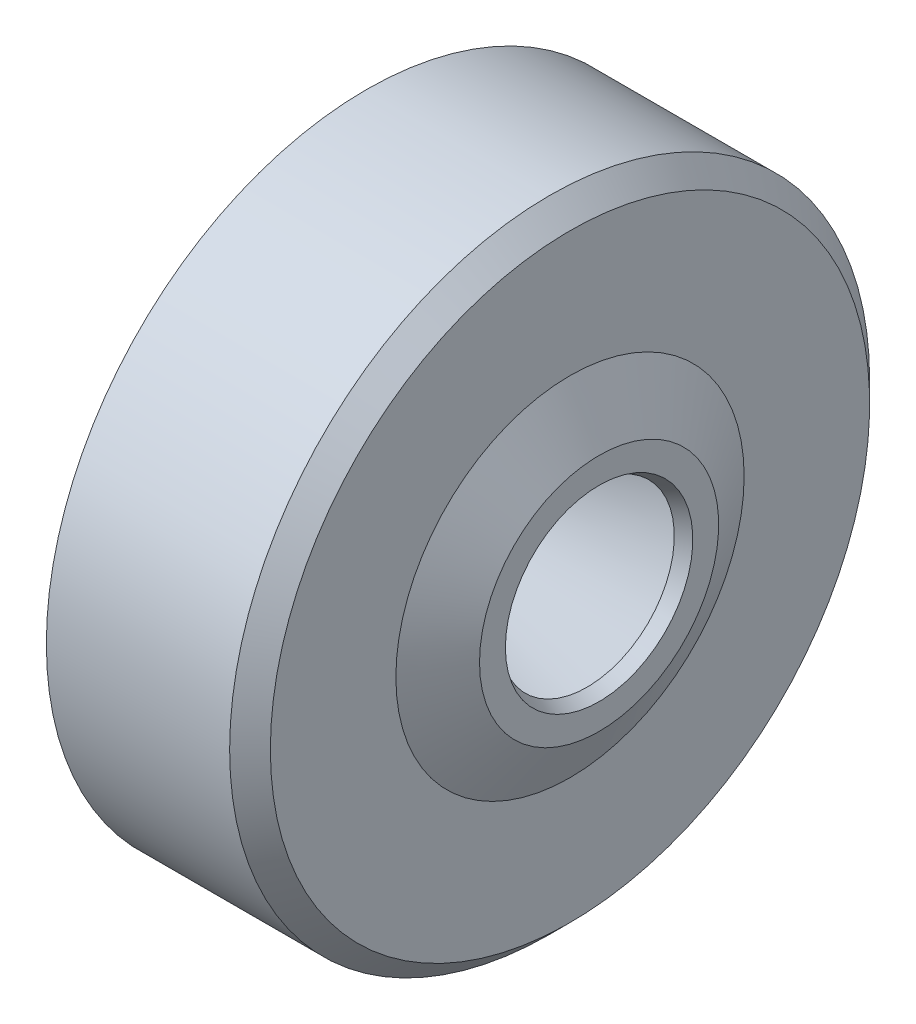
ISO-10303-21;
HEADER;
FILE_DESCRIPTION(('STEP AP214'),'2;1');
FILE_NAME('part.step','',(''),(''),'','','');
FILE_SCHEMA(('AUTOMOTIVE_DESIGN { 1 0 10303 214 1 1 1 1 }'));
ENDSEC;
DATA;
#1=APPLICATION_CONTEXT('core data for automotive mechanical design processes');
#2=APPLICATION_PROTOCOL_DEFINITION('international standard','automotive_design',2000,#1);
#3=PRODUCT_CONTEXT('',#1,'mechanical');
#4=PRODUCT('Part','Part','',(#3));
#5=PRODUCT_RELATED_PRODUCT_CATEGORY('part','',(#4));
#6=PRODUCT_DEFINITION_FORMATION('','',#4);
#7=PRODUCT_DEFINITION_CONTEXT('part definition',#1,'design');
#8=PRODUCT_DEFINITION('design','',#6,#7);
#9=PRODUCT_DEFINITION_SHAPE('','',#8);
#10=(LENGTH_UNIT() NAMED_UNIT(*) SI_UNIT(.MILLI.,.METRE.));
#11=(NAMED_UNIT(*) PLANE_ANGLE_UNIT() SI_UNIT($,.RADIAN.));
#12=(NAMED_UNIT(*) SI_UNIT($,.STERADIAN.) SOLID_ANGLE_UNIT());
#13=UNCERTAINTY_MEASURE_WITH_UNIT(LENGTH_MEASURE(1.E-05),#10,'distance_accuracy_value','');
#14=(GEOMETRIC_REPRESENTATION_CONTEXT(3) GLOBAL_UNCERTAINTY_ASSIGNED_CONTEXT((#13)) GLOBAL_UNIT_ASSIGNED_CONTEXT((#10,
#11,#12)) REPRESENTATION_CONTEXT('',''));
#15=CARTESIAN_POINT('',(0.,0.,0.));
#16=DIRECTION('',(0.,0.,1.));
#17=DIRECTION('',(1.,0.,0.));
#18=AXIS2_PLACEMENT_3D('',#15,#16,#17);
#19=CARTESIAN_POINT('',(2.10000000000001,0.,0.));
#20=DIRECTION('',(1.,0.,0.));
#21=DIRECTION('',(0.,0.,-1.));
#22=AXIS2_PLACEMENT_3D('',#19,#20,#21);
#23=CONICAL_SURFACE('',#22,3.,0.547251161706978);
#24=CARTESIAN_POINT('',(2.10000000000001,0.,0.));
#25=DIRECTION('',(-1.,0.,0.));
#26=DIRECTION('',(0.,0.,1.));
#27=AXIS2_PLACEMENT_3D('',#24,#25,#26);
#28=CIRCLE('',#27,3.);
#29=CARTESIAN_POINT('',(2.10000000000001,0.,3.));
#30=VERTEX_POINT('',#29);
#31=EDGE_CURVE('E65',#30,#30,#28,.T.);
#32=ORIENTED_EDGE('',*,*,#31,.T.);
#33=EDGE_LOOP('',(#32));
#34=FACE_BOUND('',#33,.T.);
#35=CARTESIAN_POINT('',(6.23967494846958,0.,0.));
#36=DIRECTION('',(-1.,0.,0.));
#37=DIRECTION('',(0.,0.,1.));
#38=AXIS2_PLACEMENT_3D('',#35,#36,#37);
#39=CIRCLE('',#38,5.52242584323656);
#40=CARTESIAN_POINT('',(6.23967494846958,0.,5.52242584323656));
#41=VERTEX_POINT('',#40);
#42=EDGE_CURVE('E10',#41,#41,#39,.T.);
#43=ORIENTED_EDGE('',*,*,#42,.F.);
#44=EDGE_LOOP('',(#43));
#45=FACE_BOUND('',#44,.T.);
#46=ADVANCED_FACE('F33',(#34,#45),#23,.F.);
#47=CARTESIAN_POINT('',(3.96666666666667,0.,0.));
#48=DIRECTION('',(-1.,0.,0.));
#49=DIRECTION('',(0.,0.,1.));
#50=AXIS2_PLACEMENT_3D('',#47,#48,#49);
#51=TOROIDAL_SURFACE('',#50,8.52222222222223,0.699999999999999);
#52=CARTESIAN_POINT('',(4.66666666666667,0.,0.));
#53=DIRECTION('',(-1.,0.,0.));
#54=DIRECTION('',(0.,0.,1.));
#55=AXIS2_PLACEMENT_3D('',#52,#53,#54);
#56=CIRCLE('',#55,8.52222222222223);
#57=CARTESIAN_POINT('',(4.66666666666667,0.,8.52222222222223));
#58=VERTEX_POINT('',#57);
#59=EDGE_CURVE('E40',#58,#58,#56,.T.);
#60=ORIENTED_EDGE('',*,*,#59,.F.);
#61=EDGE_LOOP('',(#60));
#62=FACE_BOUND('',#61,.T.);
#63=CARTESIAN_POINT('',(3.96666666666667,0.,0.));
#64=DIRECTION('',(-1.,0.,0.));
#65=DIRECTION('',(0.,0.,1.));
#66=AXIS2_PLACEMENT_3D('',#63,#64,#65);
#67=CIRCLE('',#66,9.22222222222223);
#68=CARTESIAN_POINT('',(3.96666666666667,0.,9.22222222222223));
#69=VERTEX_POINT('',#68);
#70=EDGE_CURVE('E80',#69,#69,#67,.T.);
#71=ORIENTED_EDGE('',*,*,#70,.T.);
#72=EDGE_LOOP('',(#71));
#73=FACE_BOUND('',#72,.T.);
#74=ADVANCED_FACE('F35',(#62,#73),#51,.F.);
#75=CARTESIAN_POINT('',(4.66666666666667,8.52222222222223,0.));
#76=DIRECTION('',(1.,0.,0.));
#77=DIRECTION('',(0.,0.,-1.));
#78=AXIS2_PLACEMENT_3D('',#75,#76,#77);
#79=PLANE('',#78);
#80=CARTESIAN_POINT('',(4.66666666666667,0.,0.));
#81=DIRECTION('',(-1.,0.,0.));
#82=DIRECTION('',(0.,0.,1.));
#83=AXIS2_PLACEMENT_3D('',#80,#81,#82);
#84=CIRCLE('',#83,5.98571428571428);
#85=CARTESIAN_POINT('',(4.66666666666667,0.,5.98571428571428));
#86=VERTEX_POINT('',#85);
#87=EDGE_CURVE('E44',#86,#86,#84,.T.);
#88=ORIENTED_EDGE('',*,*,#87,.F.);
#89=EDGE_LOOP('',(#88));
#90=FACE_BOUND('',#89,.T.);
#91=ORIENTED_EDGE('',*,*,#59,.T.);
#92=EDGE_LOOP('',(#91));
#93=FACE_BOUND('',#92,.T.);
#94=ADVANCED_FACE('F132',(#90,#93),#79,.F.);
#95=CARTESIAN_POINT('',(3.96666666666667,0.,0.));
#96=DIRECTION('',(-1.,0.,0.));
#97=DIRECTION('',(0.,0.,1.));
#98=AXIS2_PLACEMENT_3D('',#95,#96,#97);
#99=TOROIDAL_SURFACE('',#98,5.98571428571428,0.699999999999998);
#100=CARTESIAN_POINT('',(3.96666666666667,0.,0.));
#101=DIRECTION('',(-1.,0.,0.));
#102=DIRECTION('',(0.,0.,1.));
#103=AXIS2_PLACEMENT_3D('',#100,#101,#102);
#104=CIRCLE('',#103,5.28571428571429);
#105=CARTESIAN_POINT('',(3.96666666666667,0.,5.28571428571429));
#106=VERTEX_POINT('',#105);
#107=EDGE_CURVE('E48',#106,#106,#104,.T.);
#108=ORIENTED_EDGE('',*,*,#107,.F.);
#109=EDGE_LOOP('',(#108));
#110=FACE_BOUND('',#109,.T.);
#111=ORIENTED_EDGE('',*,*,#87,.T.);
#112=EDGE_LOOP('',(#111));
#113=FACE_BOUND('',#112,.T.);
#114=ADVANCED_FACE('F157',(#110,#113),#99,.F.);
#115=CARTESIAN_POINT('',(-7.00000000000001,0.,0.));
#116=DIRECTION('',(-1.,0.,0.));
#117=DIRECTION('',(0.,0.,1.));
#118=AXIS2_PLACEMENT_3D('',#115,#116,#117);
#119=CYLINDRICAL_SURFACE('',#118,5.28571428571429);
#120=CARTESIAN_POINT('',(2.10000000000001,0.,0.));
#121=DIRECTION('',(-1.,0.,0.));
#122=DIRECTION('',(0.,0.,1.));
#123=AXIS2_PLACEMENT_3D('',#120,#121,#122);
#124=CIRCLE('',#123,5.28571428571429);
#125=CARTESIAN_POINT('',(2.10000000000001,0.,5.28571428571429));
#126=VERTEX_POINT('',#125);
#127=EDGE_CURVE('E53',#126,#126,#124,.T.);
#128=ORIENTED_EDGE('',*,*,#127,.F.);
#129=EDGE_LOOP('',(#128));
#130=FACE_BOUND('',#129,.T.);
#131=ORIENTED_EDGE('',*,*,#107,.T.);
#132=EDGE_LOOP('',(#131));
#133=FACE_BOUND('',#132,.T.);
#134=ADVANCED_FACE('F153',(#130,#133),#119,.T.);
#135=CARTESIAN_POINT('',(2.10000000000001,0.,0.));
#136=DIRECTION('',(-1.,0.,0.));
#137=DIRECTION('',(0.,0.,1.));
#138=AXIS2_PLACEMENT_3D('',#135,#136,#137);
#139=TOROIDAL_SURFACE('',#138,5.98571428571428,0.699999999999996);
#140=CARTESIAN_POINT('',(1.40000000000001,0.,0.));
#141=DIRECTION('',(-1.,0.,0.));
#142=DIRECTION('',(0.,0.,1.));
#143=AXIS2_PLACEMENT_3D('',#140,#141,#142);
#144=CIRCLE('',#143,5.98571428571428);
#145=CARTESIAN_POINT('',(1.40000000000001,0.,5.98571428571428));
#146=VERTEX_POINT('',#145);
#147=EDGE_CURVE('E56',#146,#146,#144,.T.);
#148=ORIENTED_EDGE('',*,*,#147,.F.);
#149=EDGE_LOOP('',(#148));
#150=FACE_BOUND('',#149,.T.);
#151=ORIENTED_EDGE('',*,*,#127,.T.);
#152=EDGE_LOOP('',(#151));
#153=FACE_BOUND('',#152,.T.);
#154=ADVANCED_FACE('F149',(#150,#153),#139,.T.);
#155=CARTESIAN_POINT('',(-7.00000000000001,0.,0.));
#156=DIRECTION('',(-1.,0.,0.));
#157=DIRECTION('',(0.,0.,1.));
#158=AXIS2_PLACEMENT_3D('',#155,#156,#157);
#159=CYLINDRICAL_SURFACE('',#158,5.98571428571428);
#160=CARTESIAN_POINT('',(0.700000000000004,0.,0.));
#161=DIRECTION('',(-1.,0.,0.));
#162=DIRECTION('',(0.,0.,1.));
#163=AXIS2_PLACEMENT_3D('',#160,#161,#162);
#164=CIRCLE('',#163,5.98571428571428);
#165=CARTESIAN_POINT('',(0.700000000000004,0.,5.98571428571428));
#166=VERTEX_POINT('',#165);
#167=EDGE_CURVE('E59',#166,#166,#164,.T.);
#168=ORIENTED_EDGE('',*,*,#167,.F.);
#169=EDGE_LOOP('',(#168));
#170=FACE_BOUND('',#169,.T.);
#171=ORIENTED_EDGE('',*,*,#147,.T.);
#172=EDGE_LOOP('',(#171));
#173=FACE_BOUND('',#172,.T.);
#174=ADVANCED_FACE('F145',(#170,#173),#159,.T.);
#175=CARTESIAN_POINT('',(0.700000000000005,5.98571428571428,0.));
#176=DIRECTION('',(1.,0.,0.));
#177=DIRECTION('',(0.,0.,-1.));
#178=AXIS2_PLACEMENT_3D('',#175,#176,#177);
#179=PLANE('',#178);
#180=CARTESIAN_POINT('',(0.700000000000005,0.,0.));
#181=DIRECTION('',(-1.,0.,0.));
#182=DIRECTION('',(0.,0.,1.));
#183=AXIS2_PLACEMENT_3D('',#180,#181,#182);
#184=CIRCLE('',#183,4.11939942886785);
#185=CARTESIAN_POINT('',(0.700000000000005,0.,4.11939942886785));
#186=VERTEX_POINT('',#185);
#187=EDGE_CURVE('E62',#186,#186,#184,.T.);
#188=ORIENTED_EDGE('',*,*,#187,.F.);
#189=EDGE_LOOP('',(#188));
#190=FACE_BOUND('',#189,.T.);
#191=ORIENTED_EDGE('',*,*,#167,.T.);
#192=EDGE_LOOP('',(#191));
#193=FACE_BOUND('',#192,.T.);
#194=ADVANCED_FACE('F141',(#190,#193),#179,.F.);
#195=CARTESIAN_POINT('',(0.700000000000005,0.,0.));
#196=DIRECTION('',(-1.,0.,0.));
#197=DIRECTION('',(0.,0.,1.));
#198=AXIS2_PLACEMENT_3D('',#195,#196,#197);
#199=CONICAL_SURFACE('',#198,4.11939942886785,0.674479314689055);
#200=ORIENTED_EDGE('',*,*,#31,.F.);
#201=EDGE_LOOP('',(#200));
#202=FACE_BOUND('',#201,.T.);
#203=ORIENTED_EDGE('',*,*,#187,.T.);
#204=EDGE_LOOP('',(#203));
#205=FACE_BOUND('',#204,.T.);
#206=ADVANCED_FACE('F138',(#202,#205),#199,.F.);
#207=CARTESIAN_POINT('',(7.00000000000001,5.98571428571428,0.));
#208=DIRECTION('',(-1.,0.,0.));
#209=DIRECTION('',(0.,0.,1.));
#210=AXIS2_PLACEMENT_3D('',#207,#208,#209);
#211=PLANE('',#210);
#212=CARTESIAN_POINT('',(7.00000000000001,0.,0.));
#213=DIRECTION('',(-1.,0.,0.));
#214=DIRECTION('',(0.,0.,1.));
#215=AXIS2_PLACEMENT_3D('',#212,#213,#214);
#216=CIRCLE('',#215,10.3);
#217=CARTESIAN_POINT('',(7.00000000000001,0.,10.3));
#218=VERTEX_POINT('',#217);
#219=EDGE_CURVE('E68',#218,#218,#216,.T.);
#220=ORIENTED_EDGE('',*,*,#219,.F.);
#221=EDGE_LOOP('',(#220));
#222=FACE_BOUND('',#221,.T.);
#223=CARTESIAN_POINT('',(7.00000000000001,0.,0.));
#224=DIRECTION('',(-1.,0.,0.));
#225=DIRECTION('',(0.,0.,1.));
#226=AXIS2_PLACEMENT_3D('',#223,#224,#225);
#227=CIRCLE('',#226,5.98571428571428);
#228=CARTESIAN_POINT('',(7.00000000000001,0.,5.98571428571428));
#229=VERTEX_POINT('',#228);
#230=EDGE_CURVE('E92',#229,#229,#227,.T.);
#231=ORIENTED_EDGE('',*,*,#230,.T.);
#232=EDGE_LOOP('',(#231));
#233=FACE_BOUND('',#232,.T.);
#234=ADVANCED_FACE('F96',(#222,#233),#211,.F.);
#235=CARTESIAN_POINT('',(7.00000000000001,0.,0.));
#236=DIRECTION('',(-1.,0.,0.));
#237=DIRECTION('',(0.,0.,1.));
#238=AXIS2_PLACEMENT_3D('',#235,#236,#237);
#239=CONICAL_SURFACE('',#238,10.3,0.785398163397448);
#240=CARTESIAN_POINT('',(6.30000000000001,0.,0.));
#241=DIRECTION('',(-1.,0.,0.));
#242=DIRECTION('',(0.,0.,1.));
#243=AXIS2_PLACEMENT_3D('',#240,#241,#242);
#244=CIRCLE('',#243,11.);
#245=CARTESIAN_POINT('',(6.30000000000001,0.,11.));
#246=VERTEX_POINT('',#245);
#247=EDGE_CURVE('E71',#246,#246,#244,.T.);
#248=ORIENTED_EDGE('',*,*,#247,.F.);
#249=EDGE_LOOP('',(#248));
#250=FACE_BOUND('',#249,.T.);
#251=ORIENTED_EDGE('',*,*,#219,.T.);
#252=EDGE_LOOP('',(#251));
#253=FACE_BOUND('',#252,.T.);
#254=ADVANCED_FACE('F199',(#250,#253),#239,.T.);
#255=CARTESIAN_POINT('',(-7.00000000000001,0.,0.));
#256=DIRECTION('',(-1.,0.,0.));
#257=DIRECTION('',(0.,0.,1.));
#258=AXIS2_PLACEMENT_3D('',#255,#256,#257);
#259=CYLINDRICAL_SURFACE('',#258,11.);
#260=CARTESIAN_POINT('',(0.,0.,0.));
#261=DIRECTION('',(-1.,0.,0.));
#262=DIRECTION('',(0.,0.,1.));
#263=AXIS2_PLACEMENT_3D('',#260,#261,#262);
#264=CIRCLE('',#263,11.);
#265=CARTESIAN_POINT('',(0.,0.,11.));
#266=VERTEX_POINT('',#265);
#267=EDGE_CURVE('E74',#266,#266,#264,.T.);
#268=ORIENTED_EDGE('',*,*,#267,.F.);
#269=EDGE_LOOP('',(#268));
#270=FACE_BOUND('',#269,.T.);
#271=ORIENTED_EDGE('',*,*,#247,.T.);
#272=EDGE_LOOP('',(#271));
#273=FACE_BOUND('',#272,.T.);
#274=ADVANCED_FACE('F206',(#270,#273),#259,.T.);
#275=CARTESIAN_POINT('',(0.,9.22222222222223,0.));
#276=DIRECTION('',(1.,0.,0.));
#277=DIRECTION('',(0.,0.,-1.));
#278=AXIS2_PLACEMENT_3D('',#275,#276,#277);
#279=PLANE('',#278);
#280=CARTESIAN_POINT('',(0.,0.,0.));
#281=DIRECTION('',(-1.,0.,0.));
#282=DIRECTION('',(0.,0.,1.));
#283=AXIS2_PLACEMENT_3D('',#280,#281,#282);
#284=CIRCLE('',#283,9.22222222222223);
#285=CARTESIAN_POINT('',(0.,0.,9.22222222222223));
#286=VERTEX_POINT('',#285);
#287=EDGE_CURVE('E77',#286,#286,#284,.T.);
#288=ORIENTED_EDGE('',*,*,#287,.F.);
#289=EDGE_LOOP('',(#288));
#290=FACE_BOUND('',#289,.T.);
#291=ORIENTED_EDGE('',*,*,#267,.T.);
#292=EDGE_LOOP('',(#291));
#293=FACE_BOUND('',#292,.T.);
#294=ADVANCED_FACE('F123',(#290,#293),#279,.F.);
#295=CARTESIAN_POINT('',(-7.00000000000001,0.,0.));
#296=DIRECTION('',(-1.,0.,0.));
#297=DIRECTION('',(0.,0.,1.));
#298=AXIS2_PLACEMENT_3D('',#295,#296,#297);
#299=CYLINDRICAL_SURFACE('',#298,9.22222222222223);
#300=ORIENTED_EDGE('',*,*,#70,.F.);
#301=EDGE_LOOP('',(#300));
#302=FACE_BOUND('',#301,.T.);
#303=ORIENTED_EDGE('',*,*,#287,.T.);
#304=EDGE_LOOP('',(#303));
#305=FACE_BOUND('',#304,.T.);
#306=ADVANCED_FACE('F118',(#302,#305),#299,.F.);
#307=CARTESIAN_POINT('',(5.99263731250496,0.,0.));
#308=DIRECTION('',(-1.,0.,0.));
#309=DIRECTION('',(0.,0.,1.));
#310=AXIS2_PLACEMENT_3D('',#307,#308,#309);
#311=CONICAL_SURFACE('',#310,5.98571428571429,1.08092224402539);
#312=CARTESIAN_POINT('',(7.5846990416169,0.,0.));
#313=DIRECTION('',(-1.,0.,0.));
#314=DIRECTION('',(0.,0.,1.));
#315=AXIS2_PLACEMENT_3D('',#312,#313,#314);
#316=CIRCLE('',#315,3.);
#317=CARTESIAN_POINT('',(7.5846990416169,0.,3.));
#318=VERTEX_POINT('',#317);
#319=EDGE_CURVE('E83',#318,#318,#316,.T.);
#320=ORIENTED_EDGE('',*,*,#319,.F.);
#321=EDGE_LOOP('',(#320));
#322=FACE_BOUND('',#321,.T.);
#323=ORIENTED_EDGE('',*,*,#42,.T.);
#324=EDGE_LOOP('',(#323));
#325=FACE_BOUND('',#324,.T.);
#326=ADVANCED_FACE('F113',(#322,#325),#311,.F.);
#327=CARTESIAN_POINT('',(7.5846990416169,0.,0.));
#328=DIRECTION('',(1.,0.,0.));
#329=DIRECTION('',(0.,0.,-1.));
#330=AXIS2_PLACEMENT_3D('',#327,#328,#329);
#331=CONICAL_SURFACE('',#330,3.,0.489874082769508);
#332=CARTESIAN_POINT('',(8.00000000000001,0.,0.));
#333=DIRECTION('',(-1.,0.,0.));
#334=DIRECTION('',(0.,0.,1.));
#335=AXIS2_PLACEMENT_3D('',#332,#333,#334);
#336=CIRCLE('',#335,3.22144944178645);
#337=CARTESIAN_POINT('',(8.00000000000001,0.,3.22144944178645));
#338=VERTEX_POINT('',#337);
#339=EDGE_CURVE('E86',#338,#338,#336,.T.);
#340=ORIENTED_EDGE('',*,*,#339,.F.);
#341=EDGE_LOOP('',(#340));
#342=FACE_BOUND('',#341,.T.);
#343=ORIENTED_EDGE('',*,*,#319,.T.);
#344=EDGE_LOOP('',(#343));
#345=FACE_BOUND('',#344,.T.);
#346=ADVANCED_FACE('F107',(#342,#345),#331,.F.);
#347=CARTESIAN_POINT('',(8.00000000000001,4.11033833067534,0.));
#348=DIRECTION('',(-1.,0.,0.));
#349=DIRECTION('',(0.,0.,1.));
#350=AXIS2_PLACEMENT_3D('',#347,#348,#349);
#351=PLANE('',#350);
#352=CARTESIAN_POINT('',(8.00000000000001,0.,0.));
#353=DIRECTION('',(-1.,0.,0.));
#354=DIRECTION('',(0.,0.,1.));
#355=AXIS2_PLACEMENT_3D('',#352,#353,#354);
#356=CIRCLE('',#355,4.11033833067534);
#357=CARTESIAN_POINT('',(8.00000000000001,0.,4.11033833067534));
#358=VERTEX_POINT('',#357);
#359=EDGE_CURVE('E89',#358,#358,#356,.T.);
#360=ORIENTED_EDGE('',*,*,#359,.F.);
#361=EDGE_LOOP('',(#360));
#362=FACE_BOUND('',#361,.T.);
#363=ORIENTED_EDGE('',*,*,#339,.T.);
#364=EDGE_LOOP('',(#363));
#365=FACE_BOUND('',#364,.T.);
#366=ADVANCED_FACE('F101',(#362,#365),#351,.F.);
#367=CARTESIAN_POINT('',(8.00000000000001,0.,0.));
#368=DIRECTION('',(-1.,0.,0.));
#369=DIRECTION('',(0.,0.,1.));
#370=AXIS2_PLACEMENT_3D('',#367,#368,#369);
#371=CONICAL_SURFACE('',#370,4.11033833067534,1.08092224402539);
#372=ORIENTED_EDGE('',*,*,#230,.F.);
#373=EDGE_LOOP('',(#372));
#374=FACE_BOUND('',#373,.T.);
#375=ORIENTED_EDGE('',*,*,#359,.T.);
#376=EDGE_LOOP('',(#375));
#377=FACE_BOUND('',#376,.T.);
#378=ADVANCED_FACE('F98',(#374,#377),#371,.T.);
#379=CLOSED_SHELL('',(#46,#74,#94,#114,#134,#154,#174,#194,#206,#234,#254,#274,#294,#306,#326,
#346,#366,#378));
#380=MANIFOLD_SOLID_BREP('B2',#379);
#381=ADVANCED_BREP_SHAPE_REPRESENTATION('',(#18,#380),#14);
#382=SHAPE_DEFINITION_REPRESENTATION(#9,#381);
ENDSEC;
END-ISO-10303-21;
